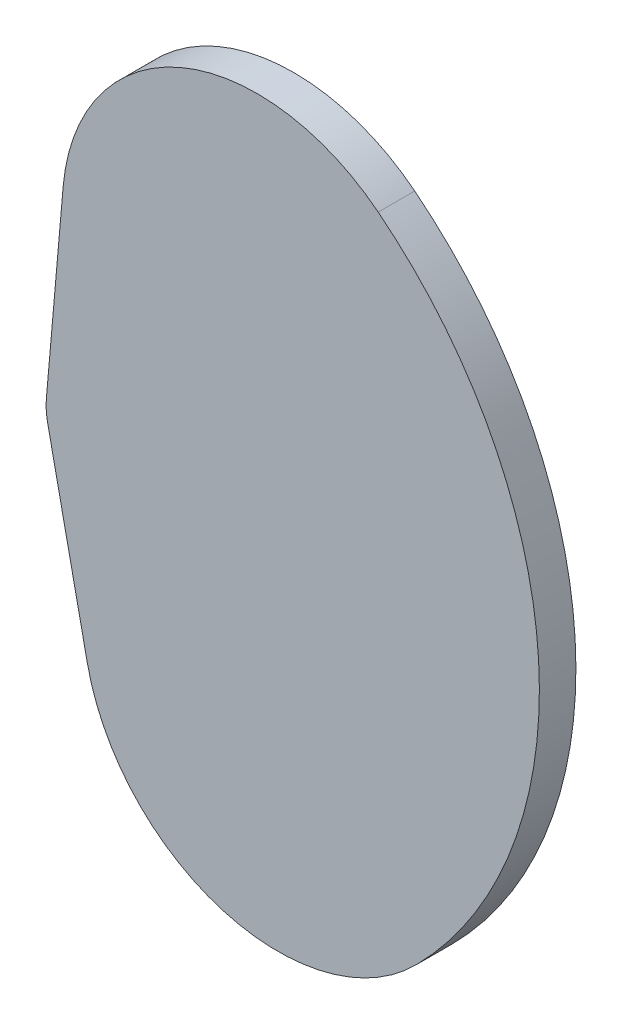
ISO-10303-21;
HEADER;
FILE_DESCRIPTION(('STEP AP214'),'2;1');
FILE_NAME('part.step','',(''),(''),'','','');
FILE_SCHEMA(('AUTOMOTIVE_DESIGN { 1 0 10303 214 1 1 1 1 }'));
ENDSEC;
DATA;
#1=APPLICATION_CONTEXT('core data for automotive mechanical design processes');
#2=APPLICATION_PROTOCOL_DEFINITION('international standard','automotive_design',2000,#1);
#3=PRODUCT_CONTEXT('',#1,'mechanical');
#4=PRODUCT('Part','Part','',(#3));
#5=PRODUCT_RELATED_PRODUCT_CATEGORY('part','',(#4));
#6=PRODUCT_DEFINITION_FORMATION('','',#4);
#7=PRODUCT_DEFINITION_CONTEXT('part definition',#1,'design');
#8=PRODUCT_DEFINITION('design','',#6,#7);
#9=PRODUCT_DEFINITION_SHAPE('','',#8);
#10=(LENGTH_UNIT() NAMED_UNIT(*) SI_UNIT(.MILLI.,.METRE.));
#11=(NAMED_UNIT(*) PLANE_ANGLE_UNIT() SI_UNIT($,.RADIAN.));
#12=(NAMED_UNIT(*) SI_UNIT($,.STERADIAN.) SOLID_ANGLE_UNIT());
#13=UNCERTAINTY_MEASURE_WITH_UNIT(LENGTH_MEASURE(1.E-05),#10,'distance_accuracy_value','');
#14=(GEOMETRIC_REPRESENTATION_CONTEXT(3) GLOBAL_UNCERTAINTY_ASSIGNED_CONTEXT((#13)) GLOBAL_UNIT_ASSIGNED_CONTEXT((#10,
#11,#12)) REPRESENTATION_CONTEXT('',''));
#15=CARTESIAN_POINT('',(0.,0.,0.));
#16=DIRECTION('',(0.,0.,1.));
#17=DIRECTION('',(1.,0.,0.));
#18=AXIS2_PLACEMENT_3D('',#15,#16,#17);
#19=CARTESIAN_POINT('',(-0.164396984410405,1.13045240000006,19.05));
#20=DIRECTION('',(0.,0.,-1.));
#21=DIRECTION('',(-1.,0.,0.));
#22=AXIS2_PLACEMENT_3D('',#19,#20,#21);
#23=CYLINDRICAL_SURFACE('',#22,101.6);
#24=CARTESIAN_POINT('',(-0.164396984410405,1.13045240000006,0.));
#25=DIRECTION('',(0.,0.,1.));
#26=DIRECTION('',(1.,0.,0.));
#27=AXIS2_PLACEMENT_3D('',#24,#25,#26);
#28=CIRCLE('',#27,101.6);
#29=CARTESIAN_POINT('',(-99.5736300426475,-19.8544083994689,0.));
#30=VERTEX_POINT('',#29);
#31=CARTESIAN_POINT('',(72.0843706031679,-70.3025622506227,0.));
#32=VERTEX_POINT('',#31);
#33=EDGE_CURVE('E82',#30,#32,#28,.T.);
#34=ORIENTED_EDGE('',*,*,#33,.T.);
#35=DIRECTION('',(0.,0.,-1.));
#36=VECTOR('',#35,1.);
#37=CARTESIAN_POINT('',(72.0843706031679,-70.3025622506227,19.05));
#38=LINE('',#37,#36);
#39=CARTESIAN_POINT('',(72.0843706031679,-70.3025622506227,19.05));
#40=VERTEX_POINT('',#39);
#41=EDGE_CURVE('E11',#40,#32,#38,.T.);
#42=ORIENTED_EDGE('',*,*,#41,.F.);
#43=CARTESIAN_POINT('',(-0.164396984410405,1.13045240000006,19.05));
#44=DIRECTION('',(0.,0.,1.));
#45=DIRECTION('',(1.,0.,0.));
#46=AXIS2_PLACEMENT_3D('',#43,#44,#45);
#47=CIRCLE('',#46,101.6);
#48=CARTESIAN_POINT('',(-99.5736300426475,-19.8544083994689,19.05));
#49=VERTEX_POINT('',#48);
#50=EDGE_CURVE('E110',#49,#40,#47,.T.);
#51=ORIENTED_EDGE('',*,*,#50,.F.);
#52=DIRECTION('',(0.,0.,-1.));
#53=VECTOR('',#52,1.);
#54=CARTESIAN_POINT('',(-99.5736300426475,-19.8544083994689,19.05));
#55=LINE('',#54,#53);
#56=EDGE_CURVE('E85',#49,#30,#55,.T.);
#57=ORIENTED_EDGE('',*,*,#56,.T.);
#58=EDGE_LOOP('',(#34,#42,#51,#57));
#59=FACE_BOUND('',#58,.T.);
#60=ADVANCED_FACE('F31',(#59),#23,.T.);
#61=CARTESIAN_POINT('',(-85.7250000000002,85.7249999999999,19.05));
#62=DIRECTION('',(0.,0.,-1.));
#63=DIRECTION('',(-1.,0.,0.));
#64=AXIS2_PLACEMENT_3D('',#61,#62,#63);
#65=CYLINDRICAL_SURFACE('',#64,221.9198);
#66=CARTESIAN_POINT('',(-85.7250000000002,85.7249999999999,0.));
#67=DIRECTION('',(0.,0.,1.));
#68=DIRECTION('',(1.,0.,0.));
#69=AXIS2_PLACEMENT_3D('',#66,#67,#68);
#70=CIRCLE('',#69,221.9198);
#71=CARTESIAN_POINT('',(52.1363830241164,259.629102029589,0.));
#72=VERTEX_POINT('',#71);
#73=EDGE_CURVE('E90',#32,#72,#70,.T.);
#74=ORIENTED_EDGE('',*,*,#73,.T.);
#75=DIRECTION('',(0.,0.,-1.));
#76=VECTOR('',#75,1.);
#77=CARTESIAN_POINT('',(52.1363830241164,259.629102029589,19.05));
#78=LINE('',#77,#76);
#79=CARTESIAN_POINT('',(52.1363830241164,259.629102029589,19.05));
#80=VERTEX_POINT('',#79);
#81=EDGE_CURVE('E38',#80,#72,#78,.T.);
#82=ORIENTED_EDGE('',*,*,#81,.F.);
#83=CARTESIAN_POINT('',(-85.7250000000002,85.7249999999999,19.05));
#84=DIRECTION('',(0.,0.,1.));
#85=DIRECTION('',(1.,0.,0.));
#86=AXIS2_PLACEMENT_3D('',#83,#84,#85);
#87=CIRCLE('',#86,221.9198);
#88=EDGE_CURVE('E97',#40,#80,#87,.T.);
#89=ORIENTED_EDGE('',*,*,#88,.F.);
#90=ORIENTED_EDGE('',*,*,#41,.T.);
#91=EDGE_LOOP('',(#74,#82,#89,#90));
#92=FACE_BOUND('',#91,.T.);
#93=ADVANCED_FACE('F94',(#92),#65,.T.);
#94=CARTESIAN_POINT('',(-10.9797360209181,180.011795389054,19.05));
#95=DIRECTION('',(0.,0.,-1.));
#96=DIRECTION('',(-1.,0.,0.));
#97=AXIS2_PLACEMENT_3D('',#94,#95,#96);
#98=CYLINDRICAL_SURFACE('',#97,101.6);
#99=CARTESIAN_POINT('',(-10.9797360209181,180.011795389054,0.));
#100=DIRECTION('',(0.,0.,1.));
#101=DIRECTION('',(1.,0.,0.));
#102=AXIS2_PLACEMENT_3D('',#99,#100,#101);
#103=CIRCLE('',#102,101.6);
#104=CARTESIAN_POINT('',(-112.193117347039,188.866818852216,0.));
#105=VERTEX_POINT('',#104);
#106=EDGE_CURVE('E100',#72,#105,#103,.T.);
#107=ORIENTED_EDGE('',*,*,#106,.T.);
#108=DIRECTION('',(0.,0.,-1.));
#109=VECTOR('',#108,1.);
#110=CARTESIAN_POINT('',(-112.193117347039,188.866818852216,19.05));
#111=LINE('',#110,#109);
#112=CARTESIAN_POINT('',(-112.193117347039,188.866818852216,19.05));
#113=VERTEX_POINT('',#112);
#114=EDGE_CURVE('E126',#113,#105,#111,.T.);
#115=ORIENTED_EDGE('',*,*,#114,.F.);
#116=CARTESIAN_POINT('',(-10.9797360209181,180.011795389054,19.05));
#117=DIRECTION('',(0.,0.,1.));
#118=DIRECTION('',(1.,0.,0.));
#119=AXIS2_PLACEMENT_3D('',#116,#117,#118);
#120=CIRCLE('',#119,101.6);
#121=EDGE_CURVE('E113',#80,#113,#120,.T.);
#122=ORIENTED_EDGE('',*,*,#121,.F.);
#123=ORIENTED_EDGE('',*,*,#81,.T.);
#124=EDGE_LOOP('',(#107,#115,#122,#123));
#125=FACE_BOUND('',#124,.T.);
#126=ADVANCED_FACE('F130',(#125),#98,.T.);
#127=CARTESIAN_POINT('',(-112.193117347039,188.866818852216,19.05));
#128=DIRECTION('',(0.996194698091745,-0.0871557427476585,0.));
#129=DIRECTION('',(0.0871557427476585,0.996194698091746,0.));
#130=AXIS2_PLACEMENT_3D('',#127,#128,#129);
#131=PLANE('',#130);
#132=DIRECTION('',(-0.0871557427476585,-0.996194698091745,0.));
#133=VECTOR('',#132,1.);
#134=CARTESIAN_POINT('',(-112.193117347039,188.866818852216,0.));
#135=LINE('',#134,#133);
#136=CARTESIAN_POINT('',(-120.94725670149,88.8065481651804,0.));
#137=VERTEX_POINT('',#136);
#138=EDGE_CURVE('E102',#105,#137,#135,.T.);
#139=ORIENTED_EDGE('',*,*,#138,.T.);
#140=DIRECTION('',(0.,0.,-1.));
#141=VECTOR('',#140,1.);
#142=CARTESIAN_POINT('',(-120.94725670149,88.8065481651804,19.05));
#143=LINE('',#142,#141);
#144=CARTESIAN_POINT('',(-120.94725670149,88.8065481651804,19.05));
#145=VERTEX_POINT('',#144);
#146=EDGE_CURVE('E123',#145,#137,#143,.T.);
#147=ORIENTED_EDGE('',*,*,#146,.F.);
#148=DIRECTION('',(-0.0871557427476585,-0.996194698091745,0.));
#149=VECTOR('',#148,1.);
#150=CARTESIAN_POINT('',(-112.193117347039,188.866818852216,19.05));
#151=LINE('',#150,#149);
#152=EDGE_CURVE('E115',#113,#145,#151,.T.);
#153=ORIENTED_EDGE('',*,*,#152,.F.);
#154=ORIENTED_EDGE('',*,*,#114,.T.);
#155=EDGE_LOOP('',(#139,#147,#153,#154));
#156=FACE_BOUND('',#155,.T.);
#157=ADVANCED_FACE('F136',(#156),#131,.F.);
#158=CARTESIAN_POINT('',(-85.7250000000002,85.7249999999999,19.05));
#159=DIRECTION('',(0.,0.,-1.));
#160=DIRECTION('',(-1.,0.,0.));
#161=AXIS2_PLACEMENT_3D('',#158,#159,#160);
#162=CYLINDRICAL_SURFACE('',#161,35.3567999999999);
#163=CARTESIAN_POINT('',(-85.7250000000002,85.7249999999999,0.));
#164=DIRECTION('',(0.,0.,1.));
#165=DIRECTION('',(1.,0.,0.));
#166=AXIS2_PLACEMENT_3D('',#163,#164,#165);
#167=CIRCLE('',#166,35.3567999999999);
#168=CARTESIAN_POINT('',(-120.319413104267,78.4222684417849,0.));
#169=VERTEX_POINT('',#168);
#170=EDGE_CURVE('E106',#137,#169,#167,.T.);
#171=ORIENTED_EDGE('',*,*,#170,.T.);
#172=DIRECTION('',(0.,0.,-1.));
#173=VECTOR('',#172,1.);
#174=CARTESIAN_POINT('',(-120.319413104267,78.4222684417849,19.05));
#175=LINE('',#174,#173);
#176=CARTESIAN_POINT('',(-120.319413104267,78.4222684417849,19.05));
#177=VERTEX_POINT('',#176);
#178=EDGE_CURVE('E120',#177,#169,#175,.T.);
#179=ORIENTED_EDGE('',*,*,#178,.F.);
#180=CARTESIAN_POINT('',(-85.7250000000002,85.7249999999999,19.05));
#181=DIRECTION('',(0.,0.,1.));
#182=DIRECTION('',(1.,0.,0.));
#183=AXIS2_PLACEMENT_3D('',#180,#181,#182);
#184=CIRCLE('',#183,35.3567999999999);
#185=EDGE_CURVE('E50',#145,#177,#184,.T.);
#186=ORIENTED_EDGE('',*,*,#185,.F.);
#187=ORIENTED_EDGE('',*,*,#146,.T.);
#188=EDGE_LOOP('',(#171,#179,#186,#187));
#189=FACE_BOUND('',#188,.T.);
#190=ADVANCED_FACE('F139',(#189),#162,.T.);
#191=CARTESIAN_POINT('',(-99.5736300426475,-19.8544083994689,19.05));
#192=DIRECTION('',(0.978437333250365,0.206543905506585,0.));
#193=DIRECTION('',(-0.206543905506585,0.978437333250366,0.));
#194=AXIS2_PLACEMENT_3D('',#191,#192,#193);
#195=PLANE('',#194);
#196=DIRECTION('',(0.206543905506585,-0.978437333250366,0.));
#197=VECTOR('',#196,1.);
#198=CARTESIAN_POINT('',(-99.5736300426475,-19.8544083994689,0.));
#199=LINE('',#198,#197);
#200=EDGE_CURVE('E108',#169,#30,#199,.T.);
#201=ORIENTED_EDGE('',*,*,#200,.T.);
#202=ORIENTED_EDGE('',*,*,#56,.F.);
#203=DIRECTION('',(0.206543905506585,-0.978437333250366,0.));
#204=VECTOR('',#203,1.);
#205=CARTESIAN_POINT('',(-99.5736300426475,-19.8544083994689,19.05));
#206=LINE('',#205,#204);
#207=EDGE_CURVE('E45',#177,#49,#206,.T.);
#208=ORIENTED_EDGE('',*,*,#207,.F.);
#209=ORIENTED_EDGE('',*,*,#178,.T.);
#210=EDGE_LOOP('',(#201,#202,#208,#209));
#211=FACE_BOUND('',#210,.T.);
#212=ADVANCED_FACE('F141',(#211),#195,.F.);
#213=CARTESIAN_POINT('',(-0.164396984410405,1.13045240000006,19.05));
#214=DIRECTION('',(0.,0.,1.));
#215=DIRECTION('',(1.,0.,0.));
#216=AXIS2_PLACEMENT_3D('',#213,#214,#215);
#217=PLANE('',#216);
#218=ORIENTED_EDGE('',*,*,#50,.T.);
#219=ORIENTED_EDGE('',*,*,#88,.T.);
#220=ORIENTED_EDGE('',*,*,#121,.T.);
#221=ORIENTED_EDGE('',*,*,#152,.T.);
#222=ORIENTED_EDGE('',*,*,#185,.T.);
#223=ORIENTED_EDGE('',*,*,#207,.T.);
#224=EDGE_LOOP('',(#218,#219,#220,#221,#222,#223));
#225=FACE_BOUND('',#224,.T.);
#226=ADVANCED_FACE('F133',(#225),#217,.T.);
#227=CARTESIAN_POINT('',(-0.164396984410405,1.13045240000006,0.));
#228=DIRECTION('',(0.,0.,1.));
#229=DIRECTION('',(1.,0.,0.));
#230=AXIS2_PLACEMENT_3D('',#227,#228,#229);
#231=PLANE('',#230);
#232=ORIENTED_EDGE('',*,*,#33,.F.);
#233=ORIENTED_EDGE('',*,*,#200,.F.);
#234=ORIENTED_EDGE('',*,*,#170,.F.);
#235=ORIENTED_EDGE('',*,*,#138,.F.);
#236=ORIENTED_EDGE('',*,*,#106,.F.);
#237=ORIENTED_EDGE('',*,*,#73,.F.);
#238=EDGE_LOOP('',(#232,#233,#234,#235,#236,#237));
#239=FACE_BOUND('',#238,.T.);
#240=ADVANCED_FACE('F98',(#239),#231,.F.);
#241=CLOSED_SHELL('',(#60,#93,#126,#157,#190,#212,#226,#240));
#242=MANIFOLD_SOLID_BREP('B2',#241);
#243=ADVANCED_BREP_SHAPE_REPRESENTATION('',(#18,#242),#14);
#244=SHAPE_DEFINITION_REPRESENTATION(#9,#243);
ENDSEC;
END-ISO-10303-21;
